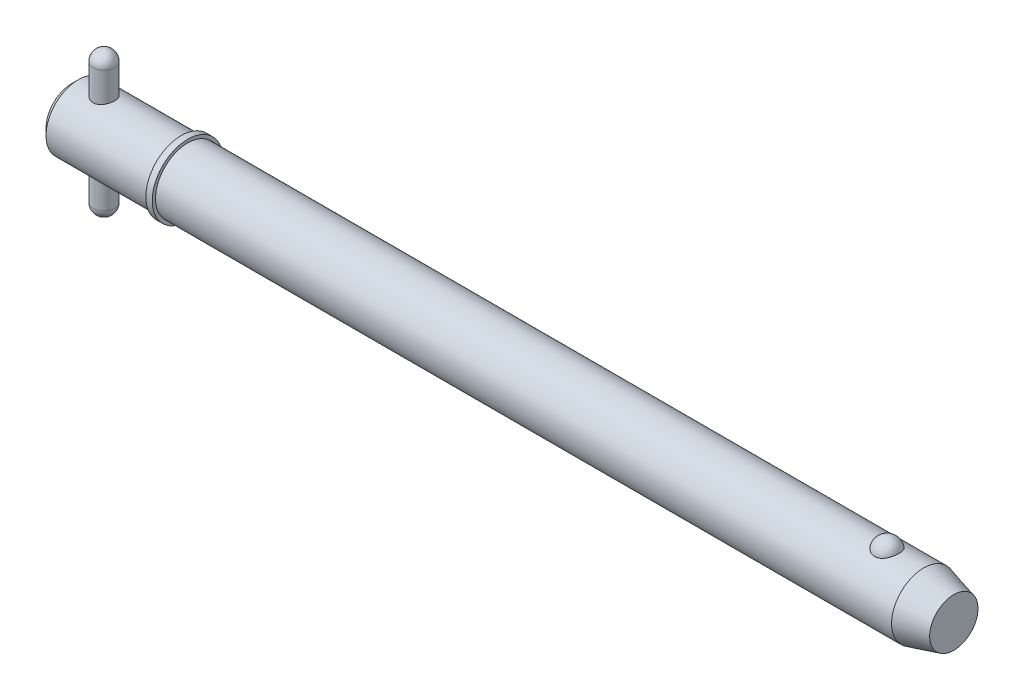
ISO-10303-21;
HEADER;
FILE_DESCRIPTION(('STEP AP214'),'2;1');
FILE_NAME('part.step','',(''),(''),'','','');
FILE_SCHEMA(('AUTOMOTIVE_DESIGN { 1 0 10303 214 1 1 1 1 }'));
ENDSEC;
DATA;
#1=APPLICATION_CONTEXT('core data for automotive mechanical design processes');
#2=APPLICATION_PROTOCOL_DEFINITION('international standard','automotive_design',2000,#1);
#3=PRODUCT_CONTEXT('',#1,'mechanical');
#4=PRODUCT('Part','Part','',(#3));
#5=PRODUCT_RELATED_PRODUCT_CATEGORY('part','',(#4));
#6=PRODUCT_DEFINITION_FORMATION('','',#4);
#7=PRODUCT_DEFINITION_CONTEXT('part definition',#1,'design');
#8=PRODUCT_DEFINITION('design','',#6,#7);
#9=PRODUCT_DEFINITION_SHAPE('','',#8);
#10=(LENGTH_UNIT() NAMED_UNIT(*) SI_UNIT(.MILLI.,.METRE.));
#11=(NAMED_UNIT(*) PLANE_ANGLE_UNIT() SI_UNIT($,.RADIAN.));
#12=(NAMED_UNIT(*) SI_UNIT($,.STERADIAN.) SOLID_ANGLE_UNIT());
#13=UNCERTAINTY_MEASURE_WITH_UNIT(LENGTH_MEASURE(1.E-05),#10,'distance_accuracy_value','');
#14=(GEOMETRIC_REPRESENTATION_CONTEXT(3) GLOBAL_UNCERTAINTY_ASSIGNED_CONTEXT((#13)) GLOBAL_UNIT_ASSIGNED_CONTEXT((#10,
#11,#12)) REPRESENTATION_CONTEXT('',''));
#15=CARTESIAN_POINT('',(0.,0.,0.));
#16=DIRECTION('',(0.,0.,1.));
#17=DIRECTION('',(1.,0.,0.));
#18=AXIS2_PLACEMENT_3D('',#15,#16,#17);
#19=CARTESIAN_POINT('',(7.14,15.875,0.));
#20=DIRECTION('',(0.,-1.,0.));
#21=DIRECTION('',(0.,0.,-1.));
#22=AXIS2_PLACEMENT_3D('',#19,#20,#21);
#23=CYLINDRICAL_SURFACE('',#22,2.38);
#24=CARTESIAN_POINT('',(7.14,-13.495,0.));
#25=DIRECTION('',(0.,-1.,0.));
#26=DIRECTION('',(0.,0.,-1.));
#27=AXIS2_PLACEMENT_3D('',#24,#25,#26);
#28=CIRCLE('',#27,2.38);
#29=CARTESIAN_POINT('',(7.14,-13.495,-2.38));
#30=VERTEX_POINT('',#29);
#31=EDGE_CURVE('P0_E10',#30,#30,#28,.F.);
#32=ORIENTED_EDGE('',*,*,#31,.T.);
#33=EDGE_LOOP('',(#32));
#34=FACE_BOUND('',#33,.T.);
#35=CARTESIAN_POINT('',(7.14,13.495,0.));
#36=DIRECTION('',(0.,-1.,0.));
#37=DIRECTION('',(0.,0.,-1.));
#38=AXIS2_PLACEMENT_3D('',#35,#36,#37);
#39=CIRCLE('',#38,2.38);
#40=CARTESIAN_POINT('',(7.14,13.495,-2.38));
#41=VERTEX_POINT('',#40);
#42=EDGE_CURVE('P0_E21',#41,#41,#39,.T.);
#43=ORIENTED_EDGE('',*,*,#42,.T.);
#44=EDGE_LOOP('',(#43));
#45=FACE_BOUND('',#44,.T.);
#46=ADVANCED_FACE('P0_F14',(#34,#45),#23,.T.);
#47=CARTESIAN_POINT('',(7.14,-13.495,0.));
#48=DIRECTION('',(0.,0.,1.));
#49=DIRECTION('',(1.,0.,0.));
#50=AXIS2_PLACEMENT_3D('',#47,#48,#49);
#51=SPHERICAL_SURFACE('',#50,2.38);
#52=CARTESIAN_POINT('',(7.14,-13.495,0.));
#53=DIRECTION('',(0.,-1.,0.));
#54=DIRECTION('',(0.,0.,-1.));
#55=AXIS2_PLACEMENT_3D('',#52,#53,#54);
#56=SPHERICAL_SURFACE('',#55,2.38);
#57=ORIENTED_EDGE('',*,*,#31,.F.);
#58=EDGE_LOOP('',(#57));
#59=FACE_BOUND('',#58,.T.);
#60=ADVANCED_FACE('P0_F29',(#59),#56,.T.);
#61=CARTESIAN_POINT('',(7.14,13.495,0.));
#62=DIRECTION('',(0.,0.,1.));
#63=DIRECTION('',(1.,0.,0.));
#64=AXIS2_PLACEMENT_3D('',#61,#62,#63);
#65=SPHERICAL_SURFACE('',#64,2.38);
#66=CARTESIAN_POINT('',(7.14,13.495,0.));
#67=DIRECTION('',(0.,-1.,0.));
#68=DIRECTION('',(0.,0.,-1.));
#69=AXIS2_PLACEMENT_3D('',#66,#67,#68);
#70=SPHERICAL_SURFACE('',#69,2.38);
#71=ORIENTED_EDGE('',*,*,#42,.F.);
#72=EDGE_LOOP('',(#71));
#73=FACE_BOUND('',#72,.T.);
#74=ADVANCED_FACE('P0_F16',(#73),#70,.T.);
#75=CLOSED_SHELL('',(#46,#60,#74));
#76=MANIFOLD_SOLID_BREP('P0_B1',#75);
#77=CARTESIAN_POINT('',(0.,0.,0.));
#78=DIRECTION('',(1.,0.,0.));
#79=DIRECTION('',(0.,0.,-1.));
#80=AXIS2_PLACEMENT_3D('',#77,#78,#79);
#81=CYLINDRICAL_SURFACE('',#80,7.145);
#82=CARTESIAN_POINT('',(188.88362424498,0.,0.));
#83=DIRECTION('',(1.,0.,0.));
#84=DIRECTION('',(0.,0.,-1.));
#85=AXIS2_PLACEMENT_3D('',#82,#83,#84);
#86=CIRCLE('',#85,7.145);
#87=CARTESIAN_POINT('',(188.88362424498,0.,-7.145));
#88=VERTEX_POINT('',#87);
#89=EDGE_CURVE('P1_E81',#88,#88,#86,.T.);
#90=ORIENTED_EDGE('',*,*,#89,.F.);
#91=EDGE_LOOP('',(#90));
#92=FACE_BOUND('',#91,.T.);
#93=CARTESIAN_POINT('',(25.7,0.,0.));
#94=DIRECTION('',(1.,0.,0.));
#95=DIRECTION('',(0.,0.,-1.));
#96=AXIS2_PLACEMENT_3D('',#93,#94,#95);
#97=CIRCLE('',#96,7.145);
#98=CARTESIAN_POINT('',(25.7,0.,-7.145));
#99=VERTEX_POINT('',#98);
#100=EDGE_CURVE('P1_E85',#99,#99,#97,.T.);
#101=ORIENTED_EDGE('',*,*,#100,.T.);
#102=EDGE_LOOP('',(#101));
#103=FACE_BOUND('',#102,.T.);
#104=CARTESIAN_POINT('',(180.739503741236,6.60328629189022,2.72903557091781));
#105=CARTESIAN_POINT('',(180.598315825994,6.60329644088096,2.72902496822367));
#106=CARTESIAN_POINT('',(180.456883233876,6.60799490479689,2.71772840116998));
#107=CARTESIAN_POINT('',(180.177955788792,6.62628236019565,2.67281935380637));
#108=CARTESIAN_POINT('',(180.040472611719,6.63989534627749,2.6391466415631));
#109=CARTESIAN_POINT('',(179.773889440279,6.67440775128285,2.55059642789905));
#110=CARTESIAN_POINT('',(179.644768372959,6.69528793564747,2.49577486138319));
#111=CARTESIAN_POINT('',(179.397869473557,6.74205585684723,2.36651799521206));
#112=CARTESIAN_POINT('',(179.280086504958,6.76794130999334,2.29209163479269));
#113=CARTESIAN_POINT('',(179.05516710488,6.82286177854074,2.12312937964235));
#114=CARTESIAN_POINT('',(178.948440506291,6.85196655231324,2.02807107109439));
#115=CARTESIAN_POINT('',(178.751918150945,6.90970232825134,1.82167822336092));
#116=CARTESIAN_POINT('',(178.662127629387,6.93833318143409,1.71033867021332));
#117=CARTESIAN_POINT('',(178.497667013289,6.9935167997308,1.46891951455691));
#118=CARTESIAN_POINT('',(178.423844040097,7.01992110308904,1.33822781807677));
#119=CARTESIAN_POINT('',(178.298088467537,7.06643385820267,1.06566567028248));
#120=CARTESIAN_POINT('',(178.24615735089,7.08654188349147,0.923794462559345));
#121=CARTESIAN_POINT('',(178.164732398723,7.11862399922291,0.630993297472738));
#122=CARTESIAN_POINT('',(178.135516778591,7.13049704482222,0.47997470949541));
#123=CARTESIAN_POINT('',(178.101174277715,7.14449484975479,0.174782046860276));
#124=CARTESIAN_POINT('',(178.096046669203,7.14661990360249,0.0206080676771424));
#125=CARTESIAN_POINT('',(178.109938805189,7.14092465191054,-0.285506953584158));
#126=CARTESIAN_POINT('',(178.128810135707,7.1331654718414,-0.437455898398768));
#127=CARTESIAN_POINT('',(178.190062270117,7.10859076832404,-0.735778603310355));
#128=CARTESIAN_POINT('',(178.232443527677,7.0917750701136,-0.882152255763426));
#129=CARTESIAN_POINT('',(178.339934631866,7.05076716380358,-1.165431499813));
#130=CARTESIAN_POINT('',(178.405075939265,7.02656475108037,-1.30232366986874));
#131=CARTESIAN_POINT('',(178.556759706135,6.97329145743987,-1.56265907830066));
#132=CARTESIAN_POINT('',(178.643303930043,6.94422017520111,-1.68610120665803));
#133=CARTESIAN_POINT('',(178.836465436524,6.88415108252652,-1.9167100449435));
#134=CARTESIAN_POINT('',(178.943180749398,6.85314438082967,-2.02379244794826));
#135=CARTESIAN_POINT('',(179.173974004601,6.79282069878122,-2.21787433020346));
#136=CARTESIAN_POINT('',(179.298050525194,6.76350358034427,-2.30487545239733));
#137=CARTESIAN_POINT('',(179.557678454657,6.71060580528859,-2.45458647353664));
#138=CARTESIAN_POINT('',(179.692938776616,6.68691885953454,-2.51776240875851));
#139=CARTESIAN_POINT('',(179.973277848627,6.64741247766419,-2.62030218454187));
#140=CARTESIAN_POINT('',(180.118352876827,6.63159007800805,-2.65967499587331));
#141=CARTESIAN_POINT('',(180.406347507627,6.61038594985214,-2.71193301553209));
#142=CARTESIAN_POINT('',(180.54900807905,6.60451880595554,-2.72605165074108));
#143=CARTESIAN_POINT('',(180.834800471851,6.60240611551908,-2.73116688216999));
#144=CARTESIAN_POINT('',(180.977932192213,6.60615862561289,-2.72216814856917));
#145=CARTESIAN_POINT('',(181.255848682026,6.62256094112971,-2.68200435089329));
#146=CARTESIAN_POINT('',(181.390754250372,6.63492533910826,-2.65154998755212));
#147=CARTESIAN_POINT('',(181.65332009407,6.66687445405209,-2.57015684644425));
#148=CARTESIAN_POINT('',(181.78097978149,6.68645975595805,-2.51921640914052));
#149=CARTESIAN_POINT('',(182.028577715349,6.73127274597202,-2.3969361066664));
#150=CARTESIAN_POINT('',(182.148287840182,6.75661381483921,-2.32517694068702));
#151=CARTESIAN_POINT('',(182.374159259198,6.81006003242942,-2.16363812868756));
#152=CARTESIAN_POINT('',(182.480317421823,6.83816581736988,-2.07385432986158));
#153=CARTESIAN_POINT('',(182.681862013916,6.89580469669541,-1.87357235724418));
#154=CARTESIAN_POINT('',(182.776440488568,6.92533863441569,-1.76226074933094));
#155=CARTESIAN_POINT('',(182.946332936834,6.981395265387,-1.52511696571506));
#156=CARTESIAN_POINT('',(183.021643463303,7.00791741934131,-1.39928219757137));
#157=CARTESIAN_POINT('',(183.153595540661,7.05607625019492,-1.13215977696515));
#158=CARTESIAN_POINT('',(183.209568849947,7.07753119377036,-0.990508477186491));
#159=CARTESIAN_POINT('',(183.298296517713,7.11222355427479,-0.699154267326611));
#160=CARTESIAN_POINT('',(183.331050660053,7.12546089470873,-0.549451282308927));
#161=CARTESIAN_POINT('',(183.372689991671,7.14237584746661,-0.246120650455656));
#162=CARTESIAN_POINT('',(183.381558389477,7.14604673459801,-0.0924903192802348));
#163=CARTESIAN_POINT('',(183.375194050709,7.14343510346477,0.214181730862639));
#164=CARTESIAN_POINT('',(183.359961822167,7.13715279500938,0.367223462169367));
#165=CARTESIAN_POINT('',(183.305845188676,7.1153294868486,0.667595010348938));
#166=CARTESIAN_POINT('',(183.267077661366,7.09983424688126,0.814949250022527));
#167=CARTESIAN_POINT('',(183.166770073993,7.06119140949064,1.10063221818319));
#168=CARTESIAN_POINT('',(183.105228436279,7.03804328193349,1.23896032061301));
#169=CARTESIAN_POINT('',(182.960207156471,6.98632429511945,1.50352300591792));
#170=CARTESIAN_POINT('',(182.876606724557,6.95772382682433,1.62968561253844));
#171=CARTESIAN_POINT('',(182.68938046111,6.89823072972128,1.86554304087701));
#172=CARTESIAN_POINT('',(182.585755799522,6.86733823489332,1.97523882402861));
#173=CARTESIAN_POINT('',(182.361076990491,6.80676456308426,2.17482293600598));
#174=CARTESIAN_POINT('',(182.240067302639,6.77708053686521,2.26476035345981));
#175=CARTESIAN_POINT('',(181.983340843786,6.72230501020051,2.42252989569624));
#176=CARTESIAN_POINT('',(181.84761851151,6.69721525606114,2.49035362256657));
#177=CARTESIAN_POINT('',(181.570402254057,6.65552591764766,2.59967646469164));
#178=CARTESIAN_POINT('',(181.429281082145,6.63865794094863,2.64202017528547));
#179=CARTESIAN_POINT('',(181.141444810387,6.61425039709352,2.70255841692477));
#180=CARTESIAN_POINT('',(180.994748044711,6.60668259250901,2.72082606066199));
#181=CARTESIAN_POINT('',(180.811679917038,6.60358754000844,2.72830331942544));
#182=CARTESIAN_POINT('',(180.775599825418,6.60328369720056,2.72903828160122));
#183=CARTESIAN_POINT('',(180.739503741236,6.60328629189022,2.72903557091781));
#184=B_SPLINE_CURVE_WITH_KNOTS('',3,(#104,#105,#106,#107,#108,#109,#110,#111,#112,#113,#114,
#115,#116,#117,#118,#119,#120,#121,#122,#123,#124,#125,#126,#127,#128,#129,#130,#131,#132,#133,
#134,#135,#136,#137,#138,#139,#140,#141,#142,#143,#144,#145,#146,#147,#148,#149,#150,#151,#152,
#153,#154,#155,#156,#157,#158,#159,#160,#161,#162,#163,#164,#165,#166,#167,#168,#169,#170,#171,
#172,#173,#174,#175,#176,#177,#178,#179,#180,#181,#182,#183),.UNSPECIFIED.,.T.,.F.,(4,2,2,2,2,2,
2,2,2,2,2,2,2,2,2,2,2,2,2,2,2,2,2,2,2,2,2,2,2,2,2,2,2,2,2,2,2,2,2,4),(0.,0.423468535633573,
0.848081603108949,1.27157926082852,1.69488414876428,2.13051395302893,2.56627819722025,
3.0213670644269,3.47648674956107,3.93709649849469,4.39769233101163,4.85545355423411,
5.31322361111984,5.77162895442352,6.23007210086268,6.69080337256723,7.15149693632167,
7.60264329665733,8.05361952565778,8.48189729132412,8.91008854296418,9.32472524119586,
9.73939553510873,10.1630783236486,10.5868588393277,11.0319070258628,11.4770347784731,
11.9362874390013,12.3955443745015,12.855124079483,13.3146940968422,13.7720003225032,
14.2293382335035,14.6892343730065,15.1491036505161,15.6078171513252,16.0667046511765,
16.5093965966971,16.9507410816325,17.0590049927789),.UNSPECIFIED.);
#185=CARTESIAN_POINT('',(180.739503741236,6.60328629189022,2.72903557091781));
#186=VERTEX_POINT('',#185);
#187=EDGE_CURVE('P1_E35',#186,#186,#184,.T.);
#188=ORIENTED_EDGE('',*,*,#187,.T.);
#189=EDGE_LOOP('',(#188));
#190=FACE_BOUND('',#189,.T.);
#191=ADVANCED_FACE('P1_F13',(#92,#103,#190),#81,.T.);
#192=CARTESIAN_POINT('',(0.,0.,0.));
#193=DIRECTION('',(-1.,0.,0.));
#194=DIRECTION('',(0.,0.,1.));
#195=AXIS2_PLACEMENT_3D('',#192,#193,#194);
#196=PLANE('',#195);
#197=CARTESIAN_POINT('',(0.,0.,0.));
#198=DIRECTION('',(1.,0.,0.));
#199=DIRECTION('',(0.,0.,-1.));
#200=AXIS2_PLACEMENT_3D('',#197,#198,#199);
#201=CIRCLE('',#200,5.716);
#202=CARTESIAN_POINT('',(0.,0.,-5.716));
#203=VERTEX_POINT('',#202);
#204=EDGE_CURVE('P1_E9',#203,#203,#201,.T.);
#205=ORIENTED_EDGE('',*,*,#204,.F.);
#206=EDGE_LOOP('',(#205));
#207=FACE_BOUND('',#206,.T.);
#208=ADVANCED_FACE('P1_F15',(#207),#196,.T.);
#209=CARTESIAN_POINT('',(1.42899999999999,0.,0.));
#210=DIRECTION('',(1.,0.,0.));
#211=DIRECTION('',(0.,0.,-1.));
#212=AXIS2_PLACEMENT_3D('',#209,#210,#211);
#213=CONICAL_SURFACE('',#212,7.145,0.78539816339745);
#214=ORIENTED_EDGE('',*,*,#204,.T.);
#215=EDGE_LOOP('',(#214));
#216=FACE_BOUND('',#215,.T.);
#217=CARTESIAN_POINT('',(1.42899999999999,0.,0.));
#218=DIRECTION('',(1.,0.,0.));
#219=DIRECTION('',(0.,0.,-1.));
#220=AXIS2_PLACEMENT_3D('',#217,#218,#219);
#221=CIRCLE('',#220,7.145);
#222=CARTESIAN_POINT('',(1.42899999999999,0.,-7.145));
#223=VERTEX_POINT('',#222);
#224=EDGE_CURVE('P1_E26',#223,#223,#221,.T.);
#225=ORIENTED_EDGE('',*,*,#224,.F.);
#226=EDGE_LOOP('',(#225));
#227=FACE_BOUND('',#226,.T.);
#228=ADVANCED_FACE('P1_F77',(#216,#227),#213,.T.);
#229=CARTESIAN_POINT('',(0.,0.,0.));
#230=DIRECTION('',(1.,0.,0.));
#231=DIRECTION('',(0.,0.,-1.));
#232=AXIS2_PLACEMENT_3D('',#229,#230,#231);
#233=CYLINDRICAL_SURFACE('',#232,7.145);
#234=CARTESIAN_POINT('',(7.14,-6.73695962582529,2.38));
#235=CARTESIAN_POINT('',(7.01035997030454,-6.73695921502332,2.38000059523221));
#236=CARTESIAN_POINT('',(6.88072348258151,-6.74074253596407,2.36937183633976));
#237=CARTESIAN_POINT('',(6.62529075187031,-6.75538853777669,2.32728080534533));
#238=CARTESIAN_POINT('',(6.49949514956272,-6.76625239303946,2.29581507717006));
#239=CARTESIAN_POINT('',(6.2554858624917,-6.79369535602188,2.21327763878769));
#240=CARTESIAN_POINT('',(6.13725786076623,-6.81026326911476,2.16224430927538));
#241=CARTESIAN_POINT('',(5.91100349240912,-6.84723128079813,2.04215132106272));
#242=CARTESIAN_POINT('',(5.80297937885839,-6.86763222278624,1.97308769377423));
#243=CARTESIAN_POINT('',(5.59597854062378,-6.91086152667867,1.81600414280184));
#244=CARTESIAN_POINT('',(5.49745861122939,-6.93375032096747,1.72739874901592));
#245=CARTESIAN_POINT('',(5.31636508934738,-6.97886546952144,1.53499636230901));
#246=CARTESIAN_POINT('',(5.23379405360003,-7.00109171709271,1.43119693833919));
#247=CARTESIAN_POINT('',(5.08487013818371,-7.04307708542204,1.20801318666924));
#248=CARTESIAN_POINT('',(5.01899578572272,-7.06275685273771,1.08829330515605));
#249=CARTESIAN_POINT('',(4.90850130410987,-7.09671988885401,0.838703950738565));
#250=CARTESIAN_POINT('',(4.86387545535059,-7.11100460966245,0.70883722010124));
#251=CARTESIAN_POINT('',(4.79869354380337,-7.13213998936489,0.44742990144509));
#252=CARTESIAN_POINT('',(4.77735497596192,-7.13923172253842,0.316104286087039));
#253=CARTESIAN_POINT('',(4.75686536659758,-7.14603777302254,0.0515578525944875));
#254=CARTESIAN_POINT('',(4.75770861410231,-7.14575398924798,-0.0816624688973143));
#255=CARTESIAN_POINT('',(4.78106216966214,-7.13800438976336,-0.340678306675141));
#256=CARTESIAN_POINT('',(4.80272255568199,-7.13082030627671,-0.466560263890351));
#257=CARTESIAN_POINT('',(4.86569013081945,-7.11043095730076,-0.712788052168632));
#258=CARTESIAN_POINT('',(4.90699865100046,-7.09722528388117,-0.833133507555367));
#259=CARTESIAN_POINT('',(5.00858673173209,-7.06591754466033,-1.06673173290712));
#260=CARTESIAN_POINT('',(5.06910834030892,-7.0477534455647,-1.17987058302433));
#261=CARTESIAN_POINT('',(5.20720514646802,-7.00841977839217,-1.39463797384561));
#262=CARTESIAN_POINT('',(5.28478508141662,-6.987249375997,-1.49626330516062));
#263=CARTESIAN_POINT('',(5.4590800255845,-6.94296010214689,-1.69017445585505));
#264=CARTESIAN_POINT('',(5.55652324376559,-6.91979641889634,-1.78179645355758));
#265=CARTESIAN_POINT('',(5.76558873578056,-6.87497076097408,-1.94761348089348));
#266=CARTESIAN_POINT('',(5.87721318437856,-6.85330901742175,-2.02180583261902));
#267=CARTESIAN_POINT('',(6.11357367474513,-6.81369485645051,-2.15157488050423));
#268=CARTESIAN_POINT('',(6.23847358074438,-6.79579956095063,-2.20687188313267));
#269=CARTESIAN_POINT('',(6.49655785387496,-6.76640630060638,-2.29542443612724));
#270=CARTESIAN_POINT('',(6.62973872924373,-6.75490565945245,-2.32868920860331));
#271=CARTESIAN_POINT('',(6.89417536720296,-6.74020933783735,-2.37088225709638));
#272=CARTESIAN_POINT('',(7.02524746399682,-6.73666278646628,-2.38083959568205));
#273=CARTESIAN_POINT('',(7.28721035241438,-6.73729555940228,-2.37904974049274));
#274=CARTESIAN_POINT('',(7.41810117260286,-6.7414734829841,-2.36730648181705));
#275=CARTESIAN_POINT('',(7.67130717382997,-6.75673471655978,-2.32337336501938));
#276=CARTESIAN_POINT('',(7.79376251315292,-6.76757635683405,-2.29189834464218));
#277=CARTESIAN_POINT('',(8.03162917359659,-6.79467771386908,-2.21025275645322));
#278=CARTESIAN_POINT('',(8.14703924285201,-6.8109383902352,-2.16007887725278));
#279=CARTESIAN_POINT('',(8.37159169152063,-6.84768362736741,-2.04065289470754));
#280=CARTESIAN_POINT('',(8.48041962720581,-6.86828569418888,-1.97084668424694));
#281=CARTESIAN_POINT('',(8.68518919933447,-6.91116416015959,-1.8147657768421));
#282=CARTESIAN_POINT('',(8.78112702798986,-6.93344105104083,-1.72848623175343));
#283=CARTESIAN_POINT('',(8.96215574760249,-6.97845348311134,-1.53698616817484));
#284=CARTESIAN_POINT('',(9.04650427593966,-7.00115965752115,-1.43105491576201));
#285=CARTESIAN_POINT('',(9.19627592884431,-7.04341676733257,-1.20598377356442));
#286=CARTESIAN_POINT('',(9.26169972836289,-7.06296781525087,-1.08684435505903));
#287=CARTESIAN_POINT('',(9.37116617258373,-7.0966205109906,-0.83933303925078));
#288=CARTESIAN_POINT('',(9.41534821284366,-7.11075755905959,-0.711027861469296));
#289=CARTESIAN_POINT('',(9.48132660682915,-7.13214194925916,-0.448245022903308));
#290=CARTESIAN_POINT('',(9.50313102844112,-7.13939177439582,-0.313769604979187));
#291=CARTESIAN_POINT('',(9.5230098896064,-7.14599771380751,-0.049254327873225));
#292=CARTESIAN_POINT('',(9.52215013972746,-7.14570837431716,0.0806974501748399));
#293=CARTESIAN_POINT('',(9.49935359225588,-7.13814116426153,0.338518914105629));
#294=CARTESIAN_POINT('',(9.47741850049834,-7.13086385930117,0.466388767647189));
#295=CARTESIAN_POINT('',(9.4138005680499,-7.11026814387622,0.714400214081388));
#296=CARTESIAN_POINT('',(9.37243609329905,-7.09704726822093,0.834632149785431));
#297=CARTESIAN_POINT('',(9.27142829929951,-7.06592602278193,1.06649582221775));
#298=CARTESIAN_POINT('',(9.2117816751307,-7.04802480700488,1.1781259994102));
#299=CARTESIAN_POINT('',(9.07336776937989,-7.00856499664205,1.39411030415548));
#300=CARTESIAN_POINT('',(8.99397590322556,-6.98689577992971,1.49804368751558));
#301=CARTESIAN_POINT('',(8.81938810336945,-6.9426110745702,1.69146078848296));
#302=CARTESIAN_POINT('',(8.72418713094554,-6.91999528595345,1.78093988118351));
#303=CARTESIAN_POINT('',(8.51623540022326,-6.87531507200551,1.94646188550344));
#304=CARTESIAN_POINT('',(8.4029442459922,-6.85330672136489,2.02184316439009));
#305=CARTESIAN_POINT('',(8.16461714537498,-6.81342065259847,2.1524427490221));
#306=CARTESIAN_POINT('',(8.03958429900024,-6.7955418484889,2.20766635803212));
#307=CARTESIAN_POINT('',(7.78712566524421,-6.76686117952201,2.29403636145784));
#308=CARTESIAN_POINT('',(7.66006989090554,-6.75577342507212,2.32616709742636));
#309=CARTESIAN_POINT('',(7.40200728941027,-6.74082409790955,2.36914495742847));
#310=CARTESIAN_POINT('',(7.27100183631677,-6.73696004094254,2.37999939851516));
#311=CARTESIAN_POINT('',(7.14,-6.73695962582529,2.38));
#312=B_SPLINE_CURVE_WITH_KNOTS('',3,(#234,#235,#236,#237,#238,#239,#240,#241,#242,#243,#244,
#245,#246,#247,#248,#249,#250,#251,#252,#253,#254,#255,#256,#257,#258,#259,#260,#261,#262,#263,
#264,#265,#266,#267,#268,#269,#270,#271,#272,#273,#274,#275,#276,#277,#278,#279,#280,#281,#282,
#283,#284,#285,#286,#287,#288,#289,#290,#291,#292,#293,#294,#295,#296,#297,#298,#299,#300,#301,
#302,#303,#304,#305,#306,#307,#308,#309,#310,#311),.UNSPECIFIED.,.T.,.F.,(4,2,2,2,2,2,2,2,2,2,2,
2,2,2,2,2,2,2,2,2,2,2,2,2,2,2,2,2,2,2,2,2,2,2,2,2,2,2,4),(0.,0.388434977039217,
0.776934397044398,1.16467566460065,1.55250234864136,1.9540847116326,2.35573139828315,
2.76784120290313,3.17984001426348,3.57752248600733,3.97510257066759,4.35711073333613,
4.7391447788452,5.12619663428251,5.51335611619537,5.91871976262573,6.3241456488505,
6.73533623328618,7.14635459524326,7.53885245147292,7.93127914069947,8.31025106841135,
8.68929014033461,9.08033871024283,9.47150254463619,9.88145528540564,10.2913934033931,
10.6986033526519,11.1056664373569,11.4936225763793,11.8815473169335,12.2633262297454,
12.645174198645,13.0411187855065,13.437189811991,13.8487371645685,14.2601761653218,
14.6528265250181,15.0453418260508),.UNSPECIFIED.);
#313=CARTESIAN_POINT('',(7.14,-6.73695962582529,2.38));
#314=VERTEX_POINT('',#313);
#315=EDGE_CURVE('P1_E17',#314,#314,#312,.T.);
#316=ORIENTED_EDGE('',*,*,#315,.F.);
#317=EDGE_LOOP('',(#316));
#318=FACE_BOUND('',#317,.T.);
#319=CARTESIAN_POINT('',(7.14,6.73695962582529,2.38));
#320=CARTESIAN_POINT('',(7.26964002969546,6.73695921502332,2.38000059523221));
#321=CARTESIAN_POINT('',(7.39927651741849,6.74074253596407,2.36937183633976));
#322=CARTESIAN_POINT('',(7.65470924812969,6.75538853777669,2.32728080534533));
#323=CARTESIAN_POINT('',(7.78050485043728,6.76625239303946,2.29581507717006));
#324=CARTESIAN_POINT('',(8.02451413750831,6.79369535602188,2.21327763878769));
#325=CARTESIAN_POINT('',(8.14274213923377,6.81026326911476,2.16224430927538));
#326=CARTESIAN_POINT('',(8.36899650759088,6.84723128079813,2.04215132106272));
#327=CARTESIAN_POINT('',(8.47702062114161,6.86763222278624,1.97308769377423));
#328=CARTESIAN_POINT('',(8.68402145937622,6.91086152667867,1.81600414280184));
#329=CARTESIAN_POINT('',(8.78254138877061,6.93375032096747,1.72739874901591));
#330=CARTESIAN_POINT('',(8.96363491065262,6.97886546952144,1.53499636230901));
#331=CARTESIAN_POINT('',(9.04620594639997,7.00109171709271,1.43119693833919));
#332=CARTESIAN_POINT('',(9.19512986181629,7.04307708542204,1.20801318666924));
#333=CARTESIAN_POINT('',(9.26100421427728,7.06275685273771,1.08829330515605));
#334=CARTESIAN_POINT('',(9.37149869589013,7.09671988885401,0.838703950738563));
#335=CARTESIAN_POINT('',(9.41612454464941,7.11100460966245,0.708837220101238));
#336=CARTESIAN_POINT('',(9.48130645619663,7.13213998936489,0.447429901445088));
#337=CARTESIAN_POINT('',(9.50264502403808,7.13923172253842,0.316104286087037));
#338=CARTESIAN_POINT('',(9.52313463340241,7.14603777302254,0.0515578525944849));
#339=CARTESIAN_POINT('',(9.52229138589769,7.14575398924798,-0.0816624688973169));
#340=CARTESIAN_POINT('',(9.49893783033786,7.13800438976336,-0.340678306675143));
#341=CARTESIAN_POINT('',(9.47727744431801,7.13082030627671,-0.466560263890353));
#342=CARTESIAN_POINT('',(9.41430986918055,7.11043095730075,-0.712788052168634));
#343=CARTESIAN_POINT('',(9.37300134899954,7.09722528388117,-0.833133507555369));
#344=CARTESIAN_POINT('',(9.27141326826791,7.06591754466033,-1.06673173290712));
#345=CARTESIAN_POINT('',(9.21089165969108,7.0477534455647,-1.17987058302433));
#346=CARTESIAN_POINT('',(9.07279485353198,7.00841977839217,-1.39463797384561));
#347=CARTESIAN_POINT('',(8.99521491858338,6.987249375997,-1.49626330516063));
#348=CARTESIAN_POINT('',(8.82091997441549,6.94296010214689,-1.69017445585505));
#349=CARTESIAN_POINT('',(8.72347675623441,6.91979641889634,-1.78179645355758));
#350=CARTESIAN_POINT('',(8.51441126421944,6.87497076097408,-1.94761348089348));
#351=CARTESIAN_POINT('',(8.40278681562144,6.85330901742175,-2.02180583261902));
#352=CARTESIAN_POINT('',(8.16642632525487,6.81369485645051,-2.15157488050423));
#353=CARTESIAN_POINT('',(8.04152641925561,6.79579956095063,-2.20687188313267));
#354=CARTESIAN_POINT('',(7.78344214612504,6.76640630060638,-2.29542443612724));
#355=CARTESIAN_POINT('',(7.65026127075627,6.75490565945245,-2.32868920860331));
#356=CARTESIAN_POINT('',(7.38582463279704,6.74020933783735,-2.37088225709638));
#357=CARTESIAN_POINT('',(7.25475253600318,6.73666278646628,-2.38083959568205));
#358=CARTESIAN_POINT('',(6.99278964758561,6.73729555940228,-2.37904974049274));
#359=CARTESIAN_POINT('',(6.86189882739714,6.7414734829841,-2.36730648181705));
#360=CARTESIAN_POINT('',(6.60869282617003,6.75673471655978,-2.32337336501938));
#361=CARTESIAN_POINT('',(6.48623748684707,6.76757635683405,-2.29189834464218));
#362=CARTESIAN_POINT('',(6.2483708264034,6.79467771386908,-2.21025275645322));
#363=CARTESIAN_POINT('',(6.13296075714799,6.8109383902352,-2.16007887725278));
#364=CARTESIAN_POINT('',(5.90840830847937,6.84768362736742,-2.04065289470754));
#365=CARTESIAN_POINT('',(5.79958037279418,6.86828569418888,-1.97084668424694));
#366=CARTESIAN_POINT('',(5.59481080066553,6.91116416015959,-1.8147657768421));
#367=CARTESIAN_POINT('',(5.49887297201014,6.93344105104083,-1.72848623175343));
#368=CARTESIAN_POINT('',(5.31784425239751,6.97845348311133,-1.53698616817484));
#369=CARTESIAN_POINT('',(5.23349572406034,7.00115965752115,-1.43105491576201));
#370=CARTESIAN_POINT('',(5.08372407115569,7.04341676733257,-1.20598377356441));
#371=CARTESIAN_POINT('',(5.01830027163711,7.06296781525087,-1.08684435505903));
#372=CARTESIAN_POINT('',(4.90883382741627,7.0966205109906,-0.839333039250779));
#373=CARTESIAN_POINT('',(4.86465178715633,7.11075755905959,-0.711027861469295));
#374=CARTESIAN_POINT('',(4.79867339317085,7.13214194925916,-0.448245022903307));
#375=CARTESIAN_POINT('',(4.77686897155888,7.13939177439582,-0.313769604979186));
#376=CARTESIAN_POINT('',(4.7569901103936,7.14599771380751,-0.0492543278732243));
#377=CARTESIAN_POINT('',(4.75784986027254,7.14570837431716,0.0806974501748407));
#378=CARTESIAN_POINT('',(4.78064640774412,7.13814116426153,0.33851891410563));
#379=CARTESIAN_POINT('',(4.80258149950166,7.13086385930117,0.46638876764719));
#380=CARTESIAN_POINT('',(4.8661994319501,7.11026814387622,0.714400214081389));
#381=CARTESIAN_POINT('',(4.90756390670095,7.09704726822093,0.834632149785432));
#382=CARTESIAN_POINT('',(5.00857170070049,7.06592602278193,1.06649582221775));
#383=CARTESIAN_POINT('',(5.0682183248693,7.04802480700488,1.1781259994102));
#384=CARTESIAN_POINT('',(5.20663223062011,7.00856499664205,1.39411030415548));
#385=CARTESIAN_POINT('',(5.28602409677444,6.98689577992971,1.49804368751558));
#386=CARTESIAN_POINT('',(5.46061189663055,6.9426110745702,1.69146078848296));
#387=CARTESIAN_POINT('',(5.55581286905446,6.91999528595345,1.78093988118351));
#388=CARTESIAN_POINT('',(5.76376459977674,6.87531507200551,1.94646188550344));
#389=CARTESIAN_POINT('',(5.8770557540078,6.85330672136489,2.02184316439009));
#390=CARTESIAN_POINT('',(6.11538285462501,6.81342065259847,2.1524427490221));
#391=CARTESIAN_POINT('',(6.24041570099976,6.7955418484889,2.20766635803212));
#392=CARTESIAN_POINT('',(6.4928743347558,6.76686117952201,2.29403636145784));
#393=CARTESIAN_POINT('',(6.61993010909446,6.75577342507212,2.32616709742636));
#394=CARTESIAN_POINT('',(6.87799271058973,6.74082409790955,2.36914495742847));
#395=CARTESIAN_POINT('',(7.00899816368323,6.73696004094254,2.37999939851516));
#396=CARTESIAN_POINT('',(7.14,6.73695962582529,2.38));
#397=B_SPLINE_CURVE_WITH_KNOTS('',3,(#319,#320,#321,#322,#323,#324,#325,#326,#327,#328,#329,
#330,#331,#332,#333,#334,#335,#336,#337,#338,#339,#340,#341,#342,#343,#344,#345,#346,#347,#348,
#349,#350,#351,#352,#353,#354,#355,#356,#357,#358,#359,#360,#361,#362,#363,#364,#365,#366,#367,
#368,#369,#370,#371,#372,#373,#374,#375,#376,#377,#378,#379,#380,#381,#382,#383,#384,#385,#386,
#387,#388,#389,#390,#391,#392,#393,#394,#395,#396),.UNSPECIFIED.,.T.,.F.,(4,2,2,2,2,2,2,2,2,2,2,
2,2,2,2,2,2,2,2,2,2,2,2,2,2,2,2,2,2,2,2,2,2,2,2,2,2,2,4),(0.,0.388434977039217,
0.776934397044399,1.16467566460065,1.55250234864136,1.9540847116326,2.35573139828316,
2.76784120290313,3.17984001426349,3.57752248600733,3.97510257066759,4.35711073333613,
4.73914477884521,5.12619663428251,5.51335611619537,5.91871976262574,6.3241456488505,
6.73533623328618,7.14635459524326,7.53885245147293,7.93127914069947,8.31025106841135,
8.68929014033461,9.08033871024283,9.47150254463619,9.88145528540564,10.2913934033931,
10.6986033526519,11.1056664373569,11.4936225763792,11.8815473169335,12.2633262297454,
12.645174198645,13.0411187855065,13.437189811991,13.8487371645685,14.2601761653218,
14.6528265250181,15.0453418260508),.UNSPECIFIED.);
#398=CARTESIAN_POINT('',(7.14,6.73695962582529,2.38));
#399=VERTEX_POINT('',#398);
#400=EDGE_CURVE('P1_E43',#399,#399,#397,.T.);
#401=ORIENTED_EDGE('',*,*,#400,.F.);
#402=EDGE_LOOP('',(#401));
#403=FACE_BOUND('',#402,.T.);
#404=ORIENTED_EDGE('',*,*,#224,.T.);
#405=EDGE_LOOP('',(#404));
#406=FACE_BOUND('',#405,.T.);
#407=CARTESIAN_POINT('',(24.271,0.,0.));
#408=DIRECTION('',(1.,0.,0.));
#409=DIRECTION('',(0.,0.,-1.));
#410=AXIS2_PLACEMENT_3D('',#407,#408,#409);
#411=CIRCLE('',#410,7.145);
#412=CARTESIAN_POINT('',(24.271,0.,-7.145));
#413=VERTEX_POINT('',#412);
#414=EDGE_CURVE('P1_E31',#413,#413,#411,.T.);
#415=ORIENTED_EDGE('',*,*,#414,.F.);
#416=EDGE_LOOP('',(#415));
#417=FACE_BOUND('',#416,.T.);
#418=ADVANCED_FACE('P1_F103',(#318,#403,#406,#417),#233,.T.);
#419=CARTESIAN_POINT('',(24.271,7.145,0.));
#420=DIRECTION('',(-1.,0.,0.));
#421=DIRECTION('',(0.,0.,1.));
#422=AXIS2_PLACEMENT_3D('',#419,#420,#421);
#423=PLANE('',#422);
#424=ORIENTED_EDGE('',*,*,#414,.T.);
#425=EDGE_LOOP('',(#424));
#426=FACE_BOUND('',#425,.T.);
#427=CARTESIAN_POINT('',(24.271,0.,0.));
#428=DIRECTION('',(1.,0.,0.));
#429=DIRECTION('',(0.,0.,-1.));
#430=AXIS2_PLACEMENT_3D('',#427,#428,#429);
#431=CIRCLE('',#430,7.8595);
#432=CARTESIAN_POINT('',(24.271,0.,-7.8595));
#433=VERTEX_POINT('',#432);
#434=EDGE_CURVE('P1_E91',#433,#433,#431,.T.);
#435=ORIENTED_EDGE('',*,*,#434,.F.);
#436=EDGE_LOOP('',(#435));
#437=FACE_BOUND('',#436,.T.);
#438=ADVANCED_FACE('P1_F100',(#426,#437),#423,.T.);
#439=CARTESIAN_POINT('',(0.,0.,0.));
#440=DIRECTION('',(1.,0.,0.));
#441=DIRECTION('',(0.,0.,-1.));
#442=AXIS2_PLACEMENT_3D('',#439,#440,#441);
#443=CYLINDRICAL_SURFACE('',#442,7.8595);
#444=ORIENTED_EDGE('',*,*,#434,.T.);
#445=EDGE_LOOP('',(#444));
#446=FACE_BOUND('',#445,.T.);
#447=CARTESIAN_POINT('',(25.7,0.,0.));
#448=DIRECTION('',(1.,0.,0.));
#449=DIRECTION('',(0.,0.,-1.));
#450=AXIS2_PLACEMENT_3D('',#447,#448,#449);
#451=CIRCLE('',#450,7.8595);
#452=CARTESIAN_POINT('',(25.7,0.,-7.8595));
#453=VERTEX_POINT('',#452);
#454=EDGE_CURVE('P1_E88',#453,#453,#451,.T.);
#455=ORIENTED_EDGE('',*,*,#454,.F.);
#456=EDGE_LOOP('',(#455));
#457=FACE_BOUND('',#456,.T.);
#458=ADVANCED_FACE('P1_F68',(#446,#457),#443,.T.);
#459=CARTESIAN_POINT('',(25.7,7.8595,0.));
#460=DIRECTION('',(1.,0.,0.));
#461=DIRECTION('',(0.,0.,-1.));
#462=AXIS2_PLACEMENT_3D('',#459,#460,#461);
#463=PLANE('',#462);
#464=ORIENTED_EDGE('',*,*,#454,.T.);
#465=EDGE_LOOP('',(#464));
#466=FACE_BOUND('',#465,.T.);
#467=ORIENTED_EDGE('',*,*,#100,.F.);
#468=EDGE_LOOP('',(#467));
#469=FACE_BOUND('',#468,.T.);
#470=ADVANCED_FACE('P1_F62',(#466,#469),#463,.T.);
#471=CARTESIAN_POINT('',(195.55,0.,0.));
#472=DIRECTION('',(-1.,0.,0.));
#473=DIRECTION('',(0.,0.,1.));
#474=AXIS2_PLACEMENT_3D('',#471,#472,#473);
#475=CONICAL_SURFACE('',#474,5.35875000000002,0.26179938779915);
#476=ORIENTED_EDGE('',*,*,#89,.T.);
#477=EDGE_LOOP('',(#476));
#478=FACE_BOUND('',#477,.T.);
#479=CARTESIAN_POINT('',(195.55,0.,0.));
#480=DIRECTION('',(1.,0.,0.));
#481=DIRECTION('',(0.,0.,-1.));
#482=AXIS2_PLACEMENT_3D('',#479,#480,#481);
#483=CIRCLE('',#482,5.35875000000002);
#484=CARTESIAN_POINT('',(195.55,0.,-5.35875000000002));
#485=VERTEX_POINT('',#484);
#486=EDGE_CURVE('P1_E42',#485,#485,#483,.T.);
#487=ORIENTED_EDGE('',*,*,#486,.F.);
#488=EDGE_LOOP('',(#487));
#489=FACE_BOUND('',#488,.T.);
#490=ADVANCED_FACE('P1_F59',(#478,#489),#475,.T.);
#491=CARTESIAN_POINT('',(195.55,5.35875000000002,0.));
#492=DIRECTION('',(1.,0.,0.));
#493=DIRECTION('',(0.,0.,-1.));
#494=AXIS2_PLACEMENT_3D('',#491,#492,#493);
#495=PLANE('',#494);
#496=ORIENTED_EDGE('',*,*,#486,.T.);
#497=EDGE_LOOP('',(#496));
#498=FACE_BOUND('',#497,.T.);
#499=ADVANCED_FACE('P1_F55',(#498),#495,.T.);
#500=CARTESIAN_POINT('',(180.739503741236,6.4305,0.));
#501=DIRECTION('',(-1.,0.,0.));
#502=DIRECTION('',(0.,-1.,0.));
#503=AXIS2_PLACEMENT_3D('',#500,#501,#502);
#504=SPHERICAL_SURFACE('',#503,2.73449999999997);
#505=ORIENTED_EDGE('',*,*,#187,.F.);
#506=EDGE_LOOP('',(#505));
#507=FACE_BOUND('',#506,.T.);
#508=ADVANCED_FACE('P1_F50',(#507),#504,.T.);
#509=CARTESIAN_POINT('',(7.14,-7.8595,0.));
#510=DIRECTION('',(0.,1.,0.));
#511=DIRECTION('',(0.,0.,1.));
#512=AXIS2_PLACEMENT_3D('',#509,#510,#511);
#513=CYLINDRICAL_SURFACE('',#512,2.38);
#514=ORIENTED_EDGE('',*,*,#315,.T.);
#515=EDGE_LOOP('',(#514));
#516=FACE_BOUND('',#515,.T.);
#517=ORIENTED_EDGE('',*,*,#400,.T.);
#518=EDGE_LOOP('',(#517));
#519=FACE_BOUND('',#518,.T.);
#520=ADVANCED_FACE('P1_F54',(#516,#519),#513,.F.);
#521=CLOSED_SHELL('',(#191,#208,#228,#418,#438,#458,#470,#490,#499,#508,#520));
#522=MANIFOLD_SOLID_BREP('P1_B1',#521);
#523=ADVANCED_BREP_SHAPE_REPRESENTATION('',(#18,#76,#522),#14);
#524=SHAPE_DEFINITION_REPRESENTATION(#9,#523);
ENDSEC;
END-ISO-10303-21;
